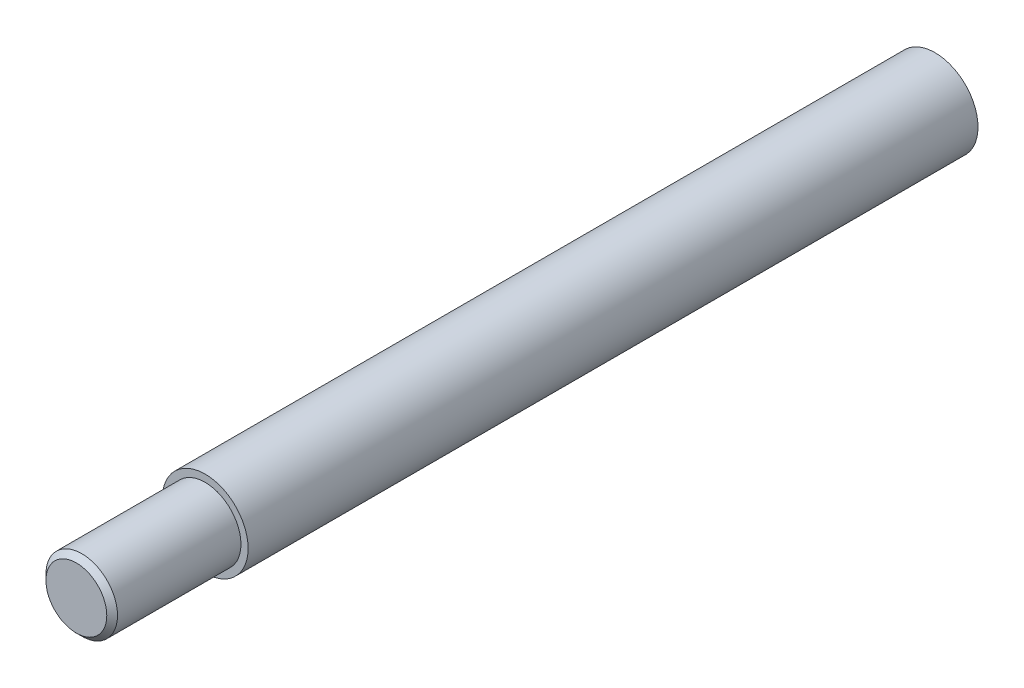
from build123d import *

# Parameters (mm, degrees)
ESQUISSE1_R             = 6
EXTRUSION1_DEPTH        = 120
ESQUISSE2_OUTSIDE_W     = 38.238
ESQUISSE2_OUTSIDE_H     = 38.238
ESQUISSE2_OUTSIDE_R     = 5
ENL_V_MAT_EXTRU_1_DEPTH = 18
CHANFREIN1_SIZE         = 0.75


with BuildPart() as part:
    # Esquisse1 → Extrusion1 (new body)
    with BuildSketch(Plane.XY):
        Circle(ESQUISSE1_R)
    extrude(amount=EXTRUSION1_DEPTH)

    # Esquisse2 outside → Enl_v. mat.-Extru.1 (cut)
    with BuildSketch(Plane.XY.offset(120)):
        Rectangle(ESQUISSE2_OUTSIDE_W, ESQUISSE2_OUTSIDE_H)
        Circle(ESQUISSE2_OUTSIDE_R, mode=Mode.SUBTRACT)
    extrude(amount=-ENL_V_MAT_EXTRU_1_DEPTH, mode=Mode.SUBTRACT)

    # Chanfrein1
    chanfrein1_edges = [part.edges().sort_by_distance(p)[0] for p in [
        (-5, 0, 120),
    ]]
    chamfer(chanfrein1_edges, length=CHANFREIN1_SIZE)


solid = part.part
